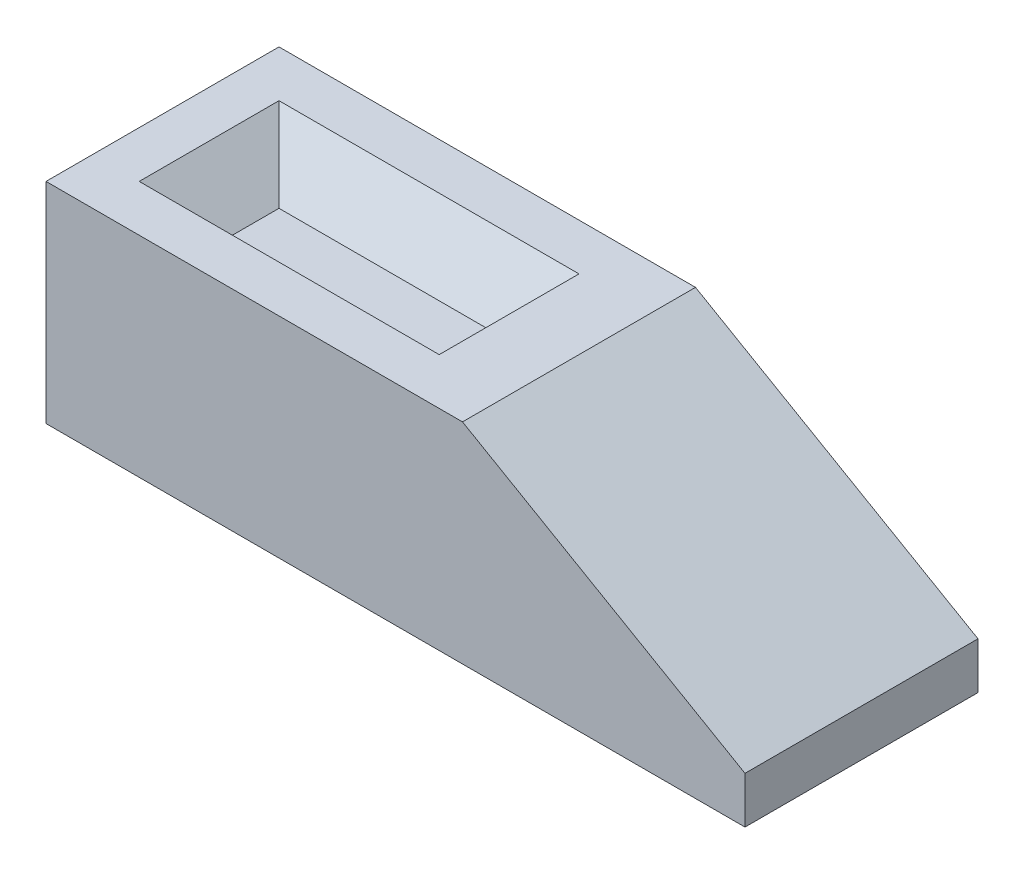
ISO-10303-21;
HEADER;
FILE_DESCRIPTION(('STEP AP214'),'2;1');
FILE_NAME('part.step','',(''),(''),'','','');
FILE_SCHEMA(('AUTOMOTIVE_DESIGN { 1 0 10303 214 1 1 1 1 }'));
ENDSEC;
DATA;
#1=APPLICATION_CONTEXT('core data for automotive mechanical design processes');
#2=APPLICATION_PROTOCOL_DEFINITION('international standard','automotive_design',2000,#1);
#3=PRODUCT_CONTEXT('',#1,'mechanical');
#4=PRODUCT('Part','Part','',(#3));
#5=PRODUCT_RELATED_PRODUCT_CATEGORY('part','',(#4));
#6=PRODUCT_DEFINITION_FORMATION('','',#4);
#7=PRODUCT_DEFINITION_CONTEXT('part definition',#1,'design');
#8=PRODUCT_DEFINITION('design','',#6,#7);
#9=PRODUCT_DEFINITION_SHAPE('','',#8);
#10=(LENGTH_UNIT() NAMED_UNIT(*) SI_UNIT(.MILLI.,.METRE.));
#11=(NAMED_UNIT(*) PLANE_ANGLE_UNIT() SI_UNIT($,.RADIAN.));
#12=(NAMED_UNIT(*) SI_UNIT($,.STERADIAN.) SOLID_ANGLE_UNIT());
#13=UNCERTAINTY_MEASURE_WITH_UNIT(LENGTH_MEASURE(1.E-05),#10,'distance_accuracy_value','');
#14=(GEOMETRIC_REPRESENTATION_CONTEXT(3) GLOBAL_UNCERTAINTY_ASSIGNED_CONTEXT((#13)) GLOBAL_UNIT_ASSIGNED_CONTEXT((#10,
#11,#12)) REPRESENTATION_CONTEXT('',''));
#15=CARTESIAN_POINT('',(0.,0.,0.));
#16=DIRECTION('',(0.,0.,1.));
#17=DIRECTION('',(1.,0.,0.));
#18=AXIS2_PLACEMENT_3D('',#15,#16,#17);
#19=CARTESIAN_POINT('',(-150.,0.,25.));
#20=DIRECTION('',(0.,1.,0.));
#21=DIRECTION('',(0.,0.,1.));
#22=AXIS2_PLACEMENT_3D('',#19,#20,#21);
#23=PLANE('',#22);
#24=DIRECTION('',(1.,0.,0.));
#25=VECTOR('',#24,1.);
#26=CARTESIAN_POINT('',(-150.,0.,-25.));
#27=LINE('',#26,#25);
#28=CARTESIAN_POINT('',(-150.,0.,-25.));
#29=VERTEX_POINT('',#28);
#30=CARTESIAN_POINT('',(0.,0.,-25.));
#31=VERTEX_POINT('',#30);
#32=EDGE_CURVE('E134',#29,#31,#27,.T.);
#33=ORIENTED_EDGE('',*,*,#32,.T.);
#34=DIRECTION('',(0.,0.,-1.));
#35=VECTOR('',#34,1.);
#36=CARTESIAN_POINT('',(0.,0.,25.));
#37=LINE('',#36,#35);
#38=CARTESIAN_POINT('',(0.,0.,25.));
#39=VERTEX_POINT('',#38);
#40=EDGE_CURVE('E11',#39,#31,#37,.T.);
#41=ORIENTED_EDGE('',*,*,#40,.F.);
#42=DIRECTION('',(1.,0.,0.));
#43=VECTOR('',#42,1.);
#44=CARTESIAN_POINT('',(-150.,0.,25.));
#45=LINE('',#44,#43);
#46=CARTESIAN_POINT('',(-150.,0.,25.));
#47=VERTEX_POINT('',#46);
#48=EDGE_CURVE('E155',#47,#39,#45,.T.);
#49=ORIENTED_EDGE('',*,*,#48,.F.);
#50=DIRECTION('',(0.,0.,-1.));
#51=VECTOR('',#50,1.);
#52=CARTESIAN_POINT('',(-150.,0.,25.));
#53=LINE('',#52,#51);
#54=EDGE_CURVE('E164',#47,#29,#53,.T.);
#55=ORIENTED_EDGE('',*,*,#54,.T.);
#56=EDGE_LOOP('',(#33,#41,#49,#55));
#57=FACE_BOUND('',#56,.T.);
#58=ADVANCED_FACE('F33',(#57),#23,.F.);
#59=CARTESIAN_POINT('',(0.,0.,25.));
#60=DIRECTION('',(-1.,0.,0.));
#61=DIRECTION('',(0.,0.,1.));
#62=AXIS2_PLACEMENT_3D('',#59,#60,#61);
#63=PLANE('',#62);
#64=DIRECTION('',(0.,1.,0.));
#65=VECTOR('',#64,1.);
#66=CARTESIAN_POINT('',(0.,0.,-25.));
#67=LINE('',#66,#65);
#68=CARTESIAN_POINT('',(0.,10.,-25.));
#69=VERTEX_POINT('',#68);
#70=EDGE_CURVE('E147',#31,#69,#67,.T.);
#71=ORIENTED_EDGE('',*,*,#70,.T.);
#72=DIRECTION('',(0.,0.,-1.));
#73=VECTOR('',#72,1.);
#74=CARTESIAN_POINT('',(0.,10.,25.));
#75=LINE('',#74,#73);
#76=CARTESIAN_POINT('',(0.,10.,25.));
#77=VERTEX_POINT('',#76);
#78=EDGE_CURVE('E40',#77,#69,#75,.T.);
#79=ORIENTED_EDGE('',*,*,#78,.F.);
#80=DIRECTION('',(0.,1.,0.));
#81=VECTOR('',#80,1.);
#82=CARTESIAN_POINT('',(0.,0.,25.));
#83=LINE('',#82,#81);
#84=EDGE_CURVE('E157',#39,#77,#83,.T.);
#85=ORIENTED_EDGE('',*,*,#84,.F.);
#86=ORIENTED_EDGE('',*,*,#40,.T.);
#87=EDGE_LOOP('',(#71,#79,#85,#86));
#88=FACE_BOUND('',#87,.T.);
#89=ADVANCED_FACE('F193',(#88),#63,.F.);
#90=CARTESIAN_POINT('',(0.,10.,25.));
#91=DIRECTION('',(-0.499999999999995,-0.866025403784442,0.));
#92=DIRECTION('',(0.866025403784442,-0.499999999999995,0.));
#93=AXIS2_PLACEMENT_3D('',#90,#91,#92);
#94=PLANE('',#93);
#95=DIRECTION('',(-0.866025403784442,0.499999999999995,0.));
#96=VECTOR('',#95,1.);
#97=CARTESIAN_POINT('',(0.,10.,-25.));
#98=LINE('',#97,#96);
#99=CARTESIAN_POINT('',(-60.6217782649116,45.,-25.));
#100=VERTEX_POINT('',#99);
#101=EDGE_CURVE('E149',#69,#100,#98,.T.);
#102=ORIENTED_EDGE('',*,*,#101,.T.);
#103=DIRECTION('',(0.,0.,-1.));
#104=VECTOR('',#103,1.);
#105=CARTESIAN_POINT('',(-60.6217782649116,45.,25.));
#106=LINE('',#105,#104);
#107=CARTESIAN_POINT('',(-60.6217782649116,45.,25.));
#108=VERTEX_POINT('',#107);
#109=EDGE_CURVE('E170',#108,#100,#106,.T.);
#110=ORIENTED_EDGE('',*,*,#109,.F.);
#111=DIRECTION('',(-0.866025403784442,0.499999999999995,0.));
#112=VECTOR('',#111,1.);
#113=CARTESIAN_POINT('',(0.,10.,25.));
#114=LINE('',#113,#112);
#115=EDGE_CURVE('E159',#77,#108,#114,.T.);
#116=ORIENTED_EDGE('',*,*,#115,.F.);
#117=ORIENTED_EDGE('',*,*,#78,.T.);
#118=EDGE_LOOP('',(#102,#110,#116,#117));
#119=FACE_BOUND('',#118,.T.);
#120=ADVANCED_FACE('F177',(#119),#94,.F.);
#121=CARTESIAN_POINT('',(-60.6217782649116,45.,25.));
#122=DIRECTION('',(0.,-1.,0.));
#123=DIRECTION('',(1.,0.,0.));
#124=AXIS2_PLACEMENT_3D('',#121,#122,#123);
#125=PLANE('',#124);
#126=DIRECTION('',(-1.,0.,0.));
#127=VECTOR('',#126,1.);
#128=CARTESIAN_POINT('',(-75.6217782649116,45.,-15.));
#129=LINE('',#128,#127);
#130=CARTESIAN_POINT('',(-75.6217782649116,45.,-15.));
#131=VERTEX_POINT('',#130);
#132=CARTESIAN_POINT('',(-140.,45.,-15.));
#133=VERTEX_POINT('',#132);
#134=EDGE_CURVE('E119',#131,#133,#129,.T.);
#135=ORIENTED_EDGE('',*,*,#134,.F.);
#136=DIRECTION('',(0.,0.,-1.));
#137=VECTOR('',#136,1.);
#138=CARTESIAN_POINT('',(-75.6217782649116,45.,15.));
#139=LINE('',#138,#137);
#140=CARTESIAN_POINT('',(-75.6217782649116,45.,15.));
#141=VERTEX_POINT('',#140);
#142=EDGE_CURVE('E47',#141,#131,#139,.T.);
#143=ORIENTED_EDGE('',*,*,#142,.F.);
#144=DIRECTION('',(1.,0.,0.));
#145=VECTOR('',#144,1.);
#146=CARTESIAN_POINT('',(-140.,45.,15.));
#147=LINE('',#146,#145);
#148=CARTESIAN_POINT('',(-140.,45.,15.));
#149=VERTEX_POINT('',#148);
#150=EDGE_CURVE('E126',#149,#141,#147,.T.);
#151=ORIENTED_EDGE('',*,*,#150,.F.);
#152=DIRECTION('',(0.,0.,1.));
#153=VECTOR('',#152,1.);
#154=CARTESIAN_POINT('',(-140.,45.,-15.));
#155=LINE('',#154,#153);
#156=EDGE_CURVE('E108',#133,#149,#155,.T.);
#157=ORIENTED_EDGE('',*,*,#156,.F.);
#158=EDGE_LOOP('',(#135,#143,#151,#157));
#159=FACE_BOUND('',#158,.T.);
#160=DIRECTION('',(-1.,0.,0.));
#161=VECTOR('',#160,1.);
#162=CARTESIAN_POINT('',(-60.6217782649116,45.,-25.));
#163=LINE('',#162,#161);
#164=CARTESIAN_POINT('',(-150.,45.,-25.));
#165=VERTEX_POINT('',#164);
#166=EDGE_CURVE('E151',#100,#165,#163,.T.);
#167=ORIENTED_EDGE('',*,*,#166,.T.);
#168=DIRECTION('',(0.,0.,-1.));
#169=VECTOR('',#168,1.);
#170=CARTESIAN_POINT('',(-150.,45.,25.));
#171=LINE('',#170,#169);
#172=CARTESIAN_POINT('',(-150.,45.,25.));
#173=VERTEX_POINT('',#172);
#174=EDGE_CURVE('E167',#173,#165,#171,.T.);
#175=ORIENTED_EDGE('',*,*,#174,.F.);
#176=DIRECTION('',(-1.,0.,0.));
#177=VECTOR('',#176,1.);
#178=CARTESIAN_POINT('',(-60.6217782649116,45.,25.));
#179=LINE('',#178,#177);
#180=EDGE_CURVE('E161',#108,#173,#179,.T.);
#181=ORIENTED_EDGE('',*,*,#180,.F.);
#182=ORIENTED_EDGE('',*,*,#109,.T.);
#183=EDGE_LOOP('',(#167,#175,#181,#182));
#184=FACE_BOUND('',#183,.T.);
#185=ADVANCED_FACE('F123',(#159,#184),#125,.F.);
#186=CARTESIAN_POINT('',(-150.,45.,25.));
#187=DIRECTION('',(1.,0.,0.));
#188=DIRECTION('',(0.,0.,-1.));
#189=AXIS2_PLACEMENT_3D('',#186,#187,#188);
#190=PLANE('',#189);
#191=DIRECTION('',(0.,-1.,0.));
#192=VECTOR('',#191,1.);
#193=CARTESIAN_POINT('',(-150.,45.,-25.));
#194=LINE('',#193,#192);
#195=EDGE_CURVE('E153',#165,#29,#194,.T.);
#196=ORIENTED_EDGE('',*,*,#195,.T.);
#197=ORIENTED_EDGE('',*,*,#54,.F.);
#198=DIRECTION('',(0.,-1.,0.));
#199=VECTOR('',#198,1.);
#200=CARTESIAN_POINT('',(-150.,45.,25.));
#201=LINE('',#200,#199);
#202=EDGE_CURVE('E55',#173,#47,#201,.T.);
#203=ORIENTED_EDGE('',*,*,#202,.F.);
#204=ORIENTED_EDGE('',*,*,#174,.T.);
#205=EDGE_LOOP('',(#196,#197,#203,#204));
#206=FACE_BOUND('',#205,.T.);
#207=ADVANCED_FACE('F188',(#206),#190,.F.);
#208=CARTESIAN_POINT('',(0.,0.,25.));
#209=DIRECTION('',(0.,0.,1.));
#210=DIRECTION('',(1.,0.,0.));
#211=AXIS2_PLACEMENT_3D('',#208,#209,#210);
#212=PLANE('',#211);
#213=ORIENTED_EDGE('',*,*,#48,.T.);
#214=ORIENTED_EDGE('',*,*,#84,.T.);
#215=ORIENTED_EDGE('',*,*,#115,.T.);
#216=ORIENTED_EDGE('',*,*,#180,.T.);
#217=ORIENTED_EDGE('',*,*,#202,.T.);
#218=EDGE_LOOP('',(#213,#214,#215,#216,#217));
#219=FACE_BOUND('',#218,.T.);
#220=ADVANCED_FACE('F192',(#219),#212,.T.);
#221=CARTESIAN_POINT('',(0.,0.,-25.));
#222=DIRECTION('',(0.,0.,1.));
#223=DIRECTION('',(1.,0.,0.));
#224=AXIS2_PLACEMENT_3D('',#221,#222,#223);
#225=PLANE('',#224);
#226=ORIENTED_EDGE('',*,*,#32,.F.);
#227=ORIENTED_EDGE('',*,*,#195,.F.);
#228=ORIENTED_EDGE('',*,*,#166,.F.);
#229=ORIENTED_EDGE('',*,*,#101,.F.);
#230=ORIENTED_EDGE('',*,*,#70,.F.);
#231=EDGE_LOOP('',(#226,#227,#228,#229,#230));
#232=FACE_BOUND('',#231,.T.);
#233=ADVANCED_FACE('F183',(#232),#225,.F.);
#234=CARTESIAN_POINT('',(-75.6217782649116,45.,15.));
#235=DIRECTION('',(0.707106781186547,-0.707106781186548,0.));
#236=DIRECTION('',(0.707106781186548,0.707106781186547,0.));
#237=AXIS2_PLACEMENT_3D('',#234,#235,#236);
#238=PLANE('',#237);
#239=ORIENTED_EDGE('',*,*,#142,.T.);
#240=DIRECTION('',(0.577350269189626,0.577350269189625,-0.577350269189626));
#241=VECTOR('',#240,1.);
#242=CARTESIAN_POINT('',(-85.6217782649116,35.,-4.99999999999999));
#243=LINE('',#242,#241);
#244=CARTESIAN_POINT('',(-85.6217782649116,35.,-4.99999999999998));
#245=VERTEX_POINT('',#244);
#246=EDGE_CURVE('E116',#245,#131,#243,.T.);
#247=ORIENTED_EDGE('',*,*,#246,.F.);
#248=DIRECTION('',(0.,0.,-1.));
#249=VECTOR('',#248,1.);
#250=CARTESIAN_POINT('',(-85.6217782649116,35.,-15.));
#251=LINE('',#250,#249);
#252=CARTESIAN_POINT('',(-85.6217782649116,35.,4.99999999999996));
#253=VERTEX_POINT('',#252);
#254=EDGE_CURVE('E128',#253,#245,#251,.T.);
#255=ORIENTED_EDGE('',*,*,#254,.F.);
#256=DIRECTION('',(0.577350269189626,0.577350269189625,0.577350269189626));
#257=VECTOR('',#256,1.);
#258=CARTESIAN_POINT('',(-97.0811855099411,23.5405927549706,-6.45940724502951));
#259=LINE('',#258,#257);
#260=EDGE_CURVE('E132',#253,#141,#259,.T.);
#261=ORIENTED_EDGE('',*,*,#260,.T.);
#262=EDGE_LOOP('',(#239,#247,#255,#261));
#263=FACE_BOUND('',#262,.T.);
#264=ADVANCED_FACE('F209',(#263),#238,.F.);
#265=CARTESIAN_POINT('',(-140.,45.,15.));
#266=DIRECTION('',(0.,-0.707106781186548,0.707106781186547));
#267=DIRECTION('',(0.,-0.707106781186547,-0.707106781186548));
#268=AXIS2_PLACEMENT_3D('',#265,#266,#267);
#269=PLANE('',#268);
#270=ORIENTED_EDGE('',*,*,#150,.T.);
#271=ORIENTED_EDGE('',*,*,#260,.F.);
#272=DIRECTION('',(1.,0.,0.));
#273=VECTOR('',#272,1.);
#274=CARTESIAN_POINT('',(-75.6217782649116,35.,4.99999999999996));
#275=LINE('',#274,#273);
#276=CARTESIAN_POINT('',(-130.,35.,4.99999999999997));
#277=VERTEX_POINT('',#276);
#278=EDGE_CURVE('E135',#277,#253,#275,.T.);
#279=ORIENTED_EDGE('',*,*,#278,.F.);
#280=DIRECTION('',(-0.577350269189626,0.577350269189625,0.577350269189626));
#281=VECTOR('',#280,1.);
#282=CARTESIAN_POINT('',(-130.,35.,4.99999999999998));
#283=LINE('',#282,#281);
#284=EDGE_CURVE('E115',#277,#149,#283,.T.);
#285=ORIENTED_EDGE('',*,*,#284,.T.);
#286=EDGE_LOOP('',(#270,#271,#279,#285));
#287=FACE_BOUND('',#286,.T.);
#288=ADVANCED_FACE('F210',(#287),#269,.F.);
#289=CARTESIAN_POINT('',(-140.,45.,-15.));
#290=DIRECTION('',(-0.707106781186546,-0.707106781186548,0.));
#291=DIRECTION('',(0.707106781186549,-0.707106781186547,0.));
#292=AXIS2_PLACEMENT_3D('',#289,#290,#291);
#293=PLANE('',#292);
#294=ORIENTED_EDGE('',*,*,#156,.T.);
#295=ORIENTED_EDGE('',*,*,#284,.F.);
#296=DIRECTION('',(0.,0.,1.));
#297=VECTOR('',#296,1.);
#298=CARTESIAN_POINT('',(-130.,35.,-15.));
#299=LINE('',#298,#297);
#300=CARTESIAN_POINT('',(-130.,35.,-4.99999999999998));
#301=VERTEX_POINT('',#300);
#302=EDGE_CURVE('E111',#301,#277,#299,.T.);
#303=ORIENTED_EDGE('',*,*,#302,.F.);
#304=DIRECTION('',(-0.577350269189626,0.577350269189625,-0.577350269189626));
#305=VECTOR('',#304,1.);
#306=CARTESIAN_POINT('',(-118.54059275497,23.5405927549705,6.4594072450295));
#307=LINE('',#306,#305);
#308=EDGE_CURVE('E104',#301,#133,#307,.T.);
#309=ORIENTED_EDGE('',*,*,#308,.T.);
#310=EDGE_LOOP('',(#294,#295,#303,#309));
#311=FACE_BOUND('',#310,.T.);
#312=ADVANCED_FACE('F106',(#311),#293,.F.);
#313=CARTESIAN_POINT('',(-75.6217782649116,45.,-15.));
#314=DIRECTION('',(0.,-0.707106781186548,-0.707106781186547));
#315=DIRECTION('',(0.,0.707106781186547,-0.707106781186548));
#316=AXIS2_PLACEMENT_3D('',#313,#314,#315);
#317=PLANE('',#316);
#318=ORIENTED_EDGE('',*,*,#134,.T.);
#319=ORIENTED_EDGE('',*,*,#308,.F.);
#320=DIRECTION('',(-1.,0.,0.));
#321=VECTOR('',#320,1.);
#322=CARTESIAN_POINT('',(-75.6217782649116,35.,-4.99999999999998));
#323=LINE('',#322,#321);
#324=EDGE_CURVE('E140',#245,#301,#323,.T.);
#325=ORIENTED_EDGE('',*,*,#324,.F.);
#326=ORIENTED_EDGE('',*,*,#246,.T.);
#327=EDGE_LOOP('',(#318,#319,#325,#326));
#328=FACE_BOUND('',#327,.T.);
#329=ADVANCED_FACE('F120',(#328),#317,.F.);
#330=CARTESIAN_POINT('',(-75.6217782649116,35.,-15.));
#331=DIRECTION('',(0.,1.,0.));
#332=DIRECTION('',(-1.,0.,0.));
#333=AXIS2_PLACEMENT_3D('',#330,#331,#332);
#334=PLANE('',#333);
#335=ORIENTED_EDGE('',*,*,#254,.T.);
#336=ORIENTED_EDGE('',*,*,#324,.T.);
#337=ORIENTED_EDGE('',*,*,#302,.T.);
#338=ORIENTED_EDGE('',*,*,#278,.T.);
#339=EDGE_LOOP('',(#335,#336,#337,#338));
#340=FACE_BOUND('',#339,.T.);
#341=ADVANCED_FACE('F218',(#340),#334,.T.);
#342=CLOSED_SHELL('',(#58,#89,#120,#185,#207,#220,#233,#264,#288,#312,#329,#341));
#343=MANIFOLD_SOLID_BREP('B2',#342);
#344=ADVANCED_BREP_SHAPE_REPRESENTATION('',(#18,#343),#14);
#345=SHAPE_DEFINITION_REPRESENTATION(#9,#344);
ENDSEC;
END-ISO-10303-21;
